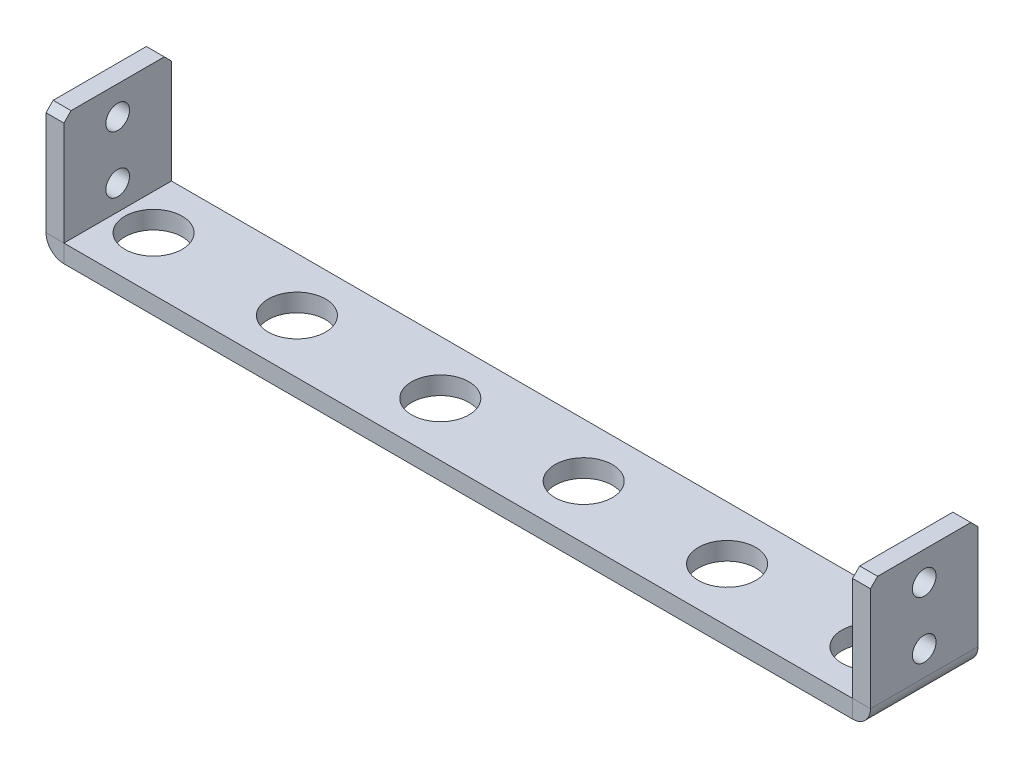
ISO-10303-21;
HEADER;
FILE_DESCRIPTION(('STEP AP214'),'2;1');
FILE_NAME('part.step','',(''),(''),'','','');
FILE_SCHEMA(('AUTOMOTIVE_DESIGN { 1 0 10303 214 1 1 1 1 }'));
ENDSEC;
DATA;
#1=APPLICATION_CONTEXT('core data for automotive mechanical design processes');
#2=APPLICATION_PROTOCOL_DEFINITION('international standard','automotive_design',2000,#1);
#3=PRODUCT_CONTEXT('',#1,'mechanical');
#4=PRODUCT('Part','Part','',(#3));
#5=PRODUCT_RELATED_PRODUCT_CATEGORY('part','',(#4));
#6=PRODUCT_DEFINITION_FORMATION('','',#4);
#7=PRODUCT_DEFINITION_CONTEXT('part definition',#1,'design');
#8=PRODUCT_DEFINITION('design','',#6,#7);
#9=PRODUCT_DEFINITION_SHAPE('','',#8);
#10=(LENGTH_UNIT() NAMED_UNIT(*) SI_UNIT(.MILLI.,.METRE.));
#11=(NAMED_UNIT(*) PLANE_ANGLE_UNIT() SI_UNIT($,.RADIAN.));
#12=(NAMED_UNIT(*) SI_UNIT($,.STERADIAN.) SOLID_ANGLE_UNIT());
#13=UNCERTAINTY_MEASURE_WITH_UNIT(LENGTH_MEASURE(1.E-05),#10,'distance_accuracy_value','');
#14=(GEOMETRIC_REPRESENTATION_CONTEXT(3) GLOBAL_UNCERTAINTY_ASSIGNED_CONTEXT((#13)) GLOBAL_UNIT_ASSIGNED_CONTEXT((#10,
#11,#12)) REPRESENTATION_CONTEXT('',''));
#15=CARTESIAN_POINT('',(0.,0.,0.));
#16=DIRECTION('',(0.,0.,1.));
#17=DIRECTION('',(1.,0.,0.));
#18=AXIS2_PLACEMENT_3D('',#15,#16,#17);
#19=CARTESIAN_POINT('',(-55.,2.5,-7.5));
#20=DIRECTION('',(0.,0.,-1.));
#21=DIRECTION('',(-1.,0.,0.));
#22=AXIS2_PLACEMENT_3D('',#19,#20,#21);
#23=PLANE('',#22);
#24=DIRECTION('',(0.,-1.,0.));
#25=VECTOR('',#24,1.);
#26=CARTESIAN_POINT('',(-55.,2.5,-7.5));
#27=LINE('',#26,#25);
#28=CARTESIAN_POINT('',(-55.,2.5,-7.5));
#29=VERTEX_POINT('',#28);
#30=CARTESIAN_POINT('',(-55.,0.,-7.5));
#31=VERTEX_POINT('',#30);
#32=EDGE_CURVE('E313',#29,#31,#27,.T.);
#33=ORIENTED_EDGE('',*,*,#32,.F.);
#34=DIRECTION('',(1.,0.,0.));
#35=VECTOR('',#34,1.);
#36=CARTESIAN_POINT('',(-57.5,2.5,-7.5));
#37=LINE('',#36,#35);
#38=CARTESIAN_POINT('',(55.,2.5,-7.5));
#39=VERTEX_POINT('',#38);
#40=EDGE_CURVE('E279',#39,#29,#37,.F.);
#41=ORIENTED_EDGE('',*,*,#40,.F.);
#42=DIRECTION('',(0.,-1.,0.));
#43=VECTOR('',#42,1.);
#44=CARTESIAN_POINT('',(55.,2.5,-7.5));
#45=LINE('',#44,#43);
#46=CARTESIAN_POINT('',(55.,0.,-7.5));
#47=VERTEX_POINT('',#46);
#48=EDGE_CURVE('E11',#39,#47,#45,.T.);
#49=ORIENTED_EDGE('',*,*,#48,.T.);
#50=DIRECTION('',(-1.,0.,0.));
#51=VECTOR('',#50,1.);
#52=CARTESIAN_POINT('',(-57.5,0.,-7.5));
#53=LINE('',#52,#51);
#54=EDGE_CURVE('E272',#47,#31,#53,.T.);
#55=ORIENTED_EDGE('',*,*,#54,.T.);
#56=EDGE_LOOP('',(#33,#41,#49,#55));
#57=FACE_BOUND('',#56,.T.);
#58=ADVANCED_FACE('F37',(#57),#23,.T.);
#59=CARTESIAN_POINT('',(55.,2.5,7.5));
#60=DIRECTION('',(0.,0.,1.));
#61=DIRECTION('',(1.,0.,0.));
#62=AXIS2_PLACEMENT_3D('',#59,#60,#61);
#63=PLANE('',#62);
#64=DIRECTION('',(0.,-1.,0.));
#65=VECTOR('',#64,1.);
#66=CARTESIAN_POINT('',(55.,2.5,7.5));
#67=LINE('',#66,#65);
#68=CARTESIAN_POINT('',(55.,2.5,7.5));
#69=VERTEX_POINT('',#68);
#70=CARTESIAN_POINT('',(55.,0.,7.5));
#71=VERTEX_POINT('',#70);
#72=EDGE_CURVE('E323',#69,#71,#67,.T.);
#73=ORIENTED_EDGE('',*,*,#72,.F.);
#74=DIRECTION('',(1.,0.,0.));
#75=VECTOR('',#74,1.);
#76=CARTESIAN_POINT('',(-57.5,2.5,7.5));
#77=LINE('',#76,#75);
#78=CARTESIAN_POINT('',(-55.,2.5,7.5));
#79=VERTEX_POINT('',#78);
#80=EDGE_CURVE('E278',#69,#79,#77,.F.);
#81=ORIENTED_EDGE('',*,*,#80,.T.);
#82=DIRECTION('',(0.,-1.,0.));
#83=VECTOR('',#82,1.);
#84=CARTESIAN_POINT('',(-55.,2.5,7.5));
#85=LINE('',#84,#83);
#86=CARTESIAN_POINT('',(-55.,0.,7.5));
#87=VERTEX_POINT('',#86);
#88=EDGE_CURVE('E317',#79,#87,#85,.T.);
#89=ORIENTED_EDGE('',*,*,#88,.T.);
#90=DIRECTION('',(-1.,0.,0.));
#91=VECTOR('',#90,1.);
#92=CARTESIAN_POINT('',(-57.5,0.,7.5));
#93=LINE('',#92,#91);
#94=EDGE_CURVE('E275',#71,#87,#93,.T.);
#95=ORIENTED_EDGE('',*,*,#94,.F.);
#96=EDGE_LOOP('',(#73,#81,#89,#95));
#97=FACE_BOUND('',#96,.T.);
#98=ADVANCED_FACE('F333',(#97),#63,.T.);
#99=CARTESIAN_POINT('',(-57.5,0.,7.5));
#100=DIRECTION('',(0.,-1.,0.));
#101=DIRECTION('',(0.,0.,-1.));
#102=AXIS2_PLACEMENT_3D('',#99,#100,#101);
#103=PLANE('',#102);
#104=CARTESIAN_POINT('',(-30.,0.,0.));
#105=DIRECTION('',(0.,1.,0.));
#106=DIRECTION('',(0.,0.,1.));
#107=AXIS2_PLACEMENT_3D('',#104,#105,#106);
#108=CIRCLE('',#107,4.);
#109=CARTESIAN_POINT('',(-30.,0.,4.));
#110=VERTEX_POINT('',#109);
#111=EDGE_CURVE('E262',#110,#110,#108,.T.);
#112=ORIENTED_EDGE('',*,*,#111,.T.);
#113=EDGE_LOOP('',(#112));
#114=FACE_BOUND('',#113,.T.);
#115=CARTESIAN_POINT('',(-50.,0.,0.));
#116=DIRECTION('',(0.,1.,0.));
#117=DIRECTION('',(0.,0.,1.));
#118=AXIS2_PLACEMENT_3D('',#115,#116,#117);
#119=CIRCLE('',#118,4.);
#120=CARTESIAN_POINT('',(-50.,0.,4.));
#121=VERTEX_POINT('',#120);
#122=EDGE_CURVE('E269',#121,#121,#119,.T.);
#123=ORIENTED_EDGE('',*,*,#122,.T.);
#124=EDGE_LOOP('',(#123));
#125=FACE_BOUND('',#124,.T.);
#126=ORIENTED_EDGE('',*,*,#54,.F.);
#127=DIRECTION('',(0.,0.,-1.));
#128=VECTOR('',#127,1.);
#129=CARTESIAN_POINT('',(55.,0.,7.5));
#130=LINE('',#129,#128);
#131=EDGE_CURVE('E45',#71,#47,#130,.T.);
#132=ORIENTED_EDGE('',*,*,#131,.F.);
#133=ORIENTED_EDGE('',*,*,#94,.T.);
#134=DIRECTION('',(0.,0.,-1.));
#135=VECTOR('',#134,1.);
#136=CARTESIAN_POINT('',(-55.,0.,7.5));
#137=LINE('',#136,#135);
#138=EDGE_CURVE('E59',#87,#31,#137,.T.);
#139=ORIENTED_EDGE('',*,*,#138,.T.);
#140=EDGE_LOOP('',(#126,#132,#133,#139));
#141=FACE_BOUND('',#140,.T.);
#142=CARTESIAN_POINT('',(-9.99999999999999,0.,0.));
#143=DIRECTION('',(0.,1.,0.));
#144=DIRECTION('',(0.,0.,1.));
#145=AXIS2_PLACEMENT_3D('',#142,#143,#144);
#146=CIRCLE('',#145,4.);
#147=CARTESIAN_POINT('',(-9.99999999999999,0.,4.));
#148=VERTEX_POINT('',#147);
#149=EDGE_CURVE('E282',#148,#148,#146,.T.);
#150=ORIENTED_EDGE('',*,*,#149,.T.);
#151=EDGE_LOOP('',(#150));
#152=FACE_BOUND('',#151,.T.);
#153=CARTESIAN_POINT('',(10.,0.,0.));
#154=DIRECTION('',(0.,1.,0.));
#155=DIRECTION('',(0.,0.,1.));
#156=AXIS2_PLACEMENT_3D('',#153,#154,#155);
#157=CIRCLE('',#156,4.);
#158=CARTESIAN_POINT('',(10.,0.,4.));
#159=VERTEX_POINT('',#158);
#160=EDGE_CURVE('E292',#159,#159,#157,.T.);
#161=ORIENTED_EDGE('',*,*,#160,.T.);
#162=EDGE_LOOP('',(#161));
#163=FACE_BOUND('',#162,.T.);
#164=CARTESIAN_POINT('',(30.,0.,0.));
#165=DIRECTION('',(0.,1.,0.));
#166=DIRECTION('',(0.,0.,1.));
#167=AXIS2_PLACEMENT_3D('',#164,#165,#166);
#168=CIRCLE('',#167,4.);
#169=CARTESIAN_POINT('',(30.,0.,4.));
#170=VERTEX_POINT('',#169);
#171=EDGE_CURVE('E298',#170,#170,#168,.T.);
#172=ORIENTED_EDGE('',*,*,#171,.T.);
#173=EDGE_LOOP('',(#172));
#174=FACE_BOUND('',#173,.T.);
#175=CARTESIAN_POINT('',(50.,0.,0.));
#176=DIRECTION('',(0.,1.,0.));
#177=DIRECTION('',(0.,0.,1.));
#178=AXIS2_PLACEMENT_3D('',#175,#176,#177);
#179=CIRCLE('',#178,4.);
#180=CARTESIAN_POINT('',(50.,0.,4.));
#181=VERTEX_POINT('',#180);
#182=EDGE_CURVE('E304',#181,#181,#179,.T.);
#183=ORIENTED_EDGE('',*,*,#182,.T.);
#184=EDGE_LOOP('',(#183));
#185=FACE_BOUND('',#184,.T.);
#186=ADVANCED_FACE('F336',(#114,#125,#141,#152,#163,#174,#185),#103,.T.);
#187=CARTESIAN_POINT('',(-57.5,2.5,7.5));
#188=DIRECTION('',(0.,-1.,0.));
#189=DIRECTION('',(0.,0.,-1.));
#190=AXIS2_PLACEMENT_3D('',#187,#188,#189);
#191=PLANE('',#190);
#192=CARTESIAN_POINT('',(-30.,2.5,0.));
#193=DIRECTION('',(0.,1.,0.));
#194=DIRECTION('',(0.,0.,1.));
#195=AXIS2_PLACEMENT_3D('',#192,#193,#194);
#196=CIRCLE('',#195,4.);
#197=CARTESIAN_POINT('',(-30.,2.5,4.));
#198=VERTEX_POINT('',#197);
#199=EDGE_CURVE('E265',#198,#198,#196,.T.);
#200=ORIENTED_EDGE('',*,*,#199,.F.);
#201=EDGE_LOOP('',(#200));
#202=FACE_BOUND('',#201,.T.);
#203=CARTESIAN_POINT('',(-50.,2.5,0.));
#204=DIRECTION('',(0.,1.,0.));
#205=DIRECTION('',(0.,0.,1.));
#206=AXIS2_PLACEMENT_3D('',#203,#204,#205);
#207=CIRCLE('',#206,4.);
#208=CARTESIAN_POINT('',(-50.,2.5,4.));
#209=VERTEX_POINT('',#208);
#210=EDGE_CURVE('E268',#209,#209,#207,.T.);
#211=ORIENTED_EDGE('',*,*,#210,.F.);
#212=EDGE_LOOP('',(#211));
#213=FACE_BOUND('',#212,.T.);
#214=ORIENTED_EDGE('',*,*,#40,.T.);
#215=DIRECTION('',(0.,0.,-1.));
#216=VECTOR('',#215,1.);
#217=CARTESIAN_POINT('',(-55.,2.5,7.5));
#218=LINE('',#217,#216);
#219=EDGE_CURVE('E310',#79,#29,#218,.T.);
#220=ORIENTED_EDGE('',*,*,#219,.F.);
#221=ORIENTED_EDGE('',*,*,#80,.F.);
#222=DIRECTION('',(0.,0.,-1.));
#223=VECTOR('',#222,1.);
#224=CARTESIAN_POINT('',(55.,2.5,7.5));
#225=LINE('',#224,#223);
#226=EDGE_CURVE('E320',#69,#39,#225,.T.);
#227=ORIENTED_EDGE('',*,*,#226,.T.);
#228=EDGE_LOOP('',(#214,#220,#221,#227));
#229=FACE_BOUND('',#228,.T.);
#230=CARTESIAN_POINT('',(-9.99999999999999,2.5,0.));
#231=DIRECTION('',(0.,1.,0.));
#232=DIRECTION('',(0.,0.,1.));
#233=AXIS2_PLACEMENT_3D('',#230,#231,#232);
#234=CIRCLE('',#233,4.);
#235=CARTESIAN_POINT('',(-9.99999999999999,2.5,4.));
#236=VERTEX_POINT('',#235);
#237=EDGE_CURVE('E289',#236,#236,#234,.T.);
#238=ORIENTED_EDGE('',*,*,#237,.F.);
#239=EDGE_LOOP('',(#238));
#240=FACE_BOUND('',#239,.T.);
#241=CARTESIAN_POINT('',(10.,2.5,0.));
#242=DIRECTION('',(0.,1.,0.));
#243=DIRECTION('',(0.,0.,1.));
#244=AXIS2_PLACEMENT_3D('',#241,#242,#243);
#245=CIRCLE('',#244,4.);
#246=CARTESIAN_POINT('',(10.,2.5,4.));
#247=VERTEX_POINT('',#246);
#248=EDGE_CURVE('E295',#247,#247,#245,.T.);
#249=ORIENTED_EDGE('',*,*,#248,.F.);
#250=EDGE_LOOP('',(#249));
#251=FACE_BOUND('',#250,.T.);
#252=CARTESIAN_POINT('',(30.,2.5,0.));
#253=DIRECTION('',(0.,1.,0.));
#254=DIRECTION('',(0.,0.,1.));
#255=AXIS2_PLACEMENT_3D('',#252,#253,#254);
#256=CIRCLE('',#255,4.);
#257=CARTESIAN_POINT('',(30.,2.5,4.));
#258=VERTEX_POINT('',#257);
#259=EDGE_CURVE('E301',#258,#258,#256,.T.);
#260=ORIENTED_EDGE('',*,*,#259,.F.);
#261=EDGE_LOOP('',(#260));
#262=FACE_BOUND('',#261,.T.);
#263=CARTESIAN_POINT('',(50.,2.5,0.));
#264=DIRECTION('',(0.,1.,0.));
#265=DIRECTION('',(0.,0.,1.));
#266=AXIS2_PLACEMENT_3D('',#263,#264,#265);
#267=CIRCLE('',#266,4.);
#268=CARTESIAN_POINT('',(50.,2.5,4.));
#269=VERTEX_POINT('',#268);
#270=EDGE_CURVE('E307',#269,#269,#267,.T.);
#271=ORIENTED_EDGE('',*,*,#270,.F.);
#272=EDGE_LOOP('',(#271));
#273=FACE_BOUND('',#272,.T.);
#274=ADVANCED_FACE('F346',(#202,#213,#229,#240,#251,#262,#273),#191,.F.);
#275=CARTESIAN_POINT('',(-50.,0.,0.));
#276=DIRECTION('',(0.,1.,0.));
#277=DIRECTION('',(0.,0.,1.));
#278=AXIS2_PLACEMENT_3D('',#275,#276,#277);
#279=CYLINDRICAL_SURFACE('',#278,4.);
#280=ORIENTED_EDGE('',*,*,#122,.F.);
#281=EDGE_LOOP('',(#280));
#282=FACE_BOUND('',#281,.T.);
#283=ORIENTED_EDGE('',*,*,#210,.T.);
#284=EDGE_LOOP('',(#283));
#285=FACE_BOUND('',#284,.T.);
#286=ADVANCED_FACE('F407',(#282,#285),#279,.F.);
#287=CARTESIAN_POINT('',(-30.,0.,0.));
#288=DIRECTION('',(0.,1.,0.));
#289=DIRECTION('',(0.,0.,1.));
#290=AXIS2_PLACEMENT_3D('',#287,#288,#289);
#291=CYLINDRICAL_SURFACE('',#290,4.);
#292=ORIENTED_EDGE('',*,*,#111,.F.);
#293=EDGE_LOOP('',(#292));
#294=FACE_BOUND('',#293,.T.);
#295=ORIENTED_EDGE('',*,*,#199,.T.);
#296=EDGE_LOOP('',(#295));
#297=FACE_BOUND('',#296,.T.);
#298=ADVANCED_FACE('F389',(#294,#297),#291,.F.);
#299=CARTESIAN_POINT('',(-9.99999999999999,0.,0.));
#300=DIRECTION('',(0.,1.,0.));
#301=DIRECTION('',(0.,0.,1.));
#302=AXIS2_PLACEMENT_3D('',#299,#300,#301);
#303=CYLINDRICAL_SURFACE('',#302,4.);
#304=ORIENTED_EDGE('',*,*,#149,.F.);
#305=EDGE_LOOP('',(#304));
#306=FACE_BOUND('',#305,.T.);
#307=ORIENTED_EDGE('',*,*,#237,.T.);
#308=EDGE_LOOP('',(#307));
#309=FACE_BOUND('',#308,.T.);
#310=ADVANCED_FACE('F385',(#306,#309),#303,.F.);
#311=CARTESIAN_POINT('',(10.,0.,0.));
#312=DIRECTION('',(0.,1.,0.));
#313=DIRECTION('',(0.,0.,1.));
#314=AXIS2_PLACEMENT_3D('',#311,#312,#313);
#315=CYLINDRICAL_SURFACE('',#314,4.);
#316=ORIENTED_EDGE('',*,*,#160,.F.);
#317=EDGE_LOOP('',(#316));
#318=FACE_BOUND('',#317,.T.);
#319=ORIENTED_EDGE('',*,*,#248,.T.);
#320=EDGE_LOOP('',(#319));
#321=FACE_BOUND('',#320,.T.);
#322=ADVANCED_FACE('F388',(#318,#321),#315,.F.);
#323=CARTESIAN_POINT('',(30.,0.,0.));
#324=DIRECTION('',(0.,1.,0.));
#325=DIRECTION('',(0.,0.,1.));
#326=AXIS2_PLACEMENT_3D('',#323,#324,#325);
#327=CYLINDRICAL_SURFACE('',#326,4.);
#328=ORIENTED_EDGE('',*,*,#171,.F.);
#329=EDGE_LOOP('',(#328));
#330=FACE_BOUND('',#329,.T.);
#331=ORIENTED_EDGE('',*,*,#259,.T.);
#332=EDGE_LOOP('',(#331));
#333=FACE_BOUND('',#332,.T.);
#334=ADVANCED_FACE('F392',(#330,#333),#327,.F.);
#335=CARTESIAN_POINT('',(50.,0.,0.));
#336=DIRECTION('',(0.,1.,0.));
#337=DIRECTION('',(0.,0.,1.));
#338=AXIS2_PLACEMENT_3D('',#335,#336,#337);
#339=CYLINDRICAL_SURFACE('',#338,4.);
#340=ORIENTED_EDGE('',*,*,#182,.F.);
#341=EDGE_LOOP('',(#340));
#342=FACE_BOUND('',#341,.T.);
#343=ORIENTED_EDGE('',*,*,#270,.T.);
#344=EDGE_LOOP('',(#343));
#345=FACE_BOUND('',#344,.T.);
#346=ADVANCED_FACE('F39',(#342,#345),#339,.F.);
#347=CARTESIAN_POINT('',(-55.,2.5,-7.5));
#348=DIRECTION('',(0.,0.,1.));
#349=DIRECTION('',(1.,0.,0.));
#350=AXIS2_PLACEMENT_3D('',#347,#348,#349);
#351=PLANE('',#350);
#352=CARTESIAN_POINT('',(-55.,2.5,-7.5));
#353=DIRECTION('',(0.,0.,1.));
#354=DIRECTION('',(1.,0.,0.));
#355=AXIS2_PLACEMENT_3D('',#352,#353,#354);
#356=CIRCLE('',#355,2.50000000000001);
#357=CARTESIAN_POINT('',(-57.5,2.5,-7.5));
#358=VERTEX_POINT('',#357);
#359=EDGE_CURVE('E260',#358,#31,#356,.T.);
#360=ORIENTED_EDGE('',*,*,#359,.F.);
#361=DIRECTION('',(-1.,0.,0.));
#362=VECTOR('',#361,1.);
#363=CARTESIAN_POINT('',(-55.,2.5,-7.5));
#364=LINE('',#363,#362);
#365=EDGE_CURVE('E219',#29,#358,#364,.T.);
#366=ORIENTED_EDGE('',*,*,#365,.F.);
#367=ORIENTED_EDGE('',*,*,#32,.T.);
#368=EDGE_LOOP('',(#360,#366,#367));
#369=FACE_BOUND('',#368,.T.);
#370=ADVANCED_FACE('F399',(#369),#351,.F.);
#371=CARTESIAN_POINT('',(-55.,2.5,7.5));
#372=DIRECTION('',(0.,0.,1.));
#373=DIRECTION('',(1.,0.,0.));
#374=AXIS2_PLACEMENT_3D('',#371,#372,#373);
#375=CYLINDRICAL_SURFACE('',#374,2.50000000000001);
#376=CARTESIAN_POINT('',(-55.,2.5,7.5));
#377=DIRECTION('',(0.,0.,1.));
#378=DIRECTION('',(1.,0.,0.));
#379=AXIS2_PLACEMENT_3D('',#376,#377,#378);
#380=CIRCLE('',#379,2.50000000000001);
#381=CARTESIAN_POINT('',(-57.5,2.50000000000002,7.5));
#382=VERTEX_POINT('',#381);
#383=EDGE_CURVE('E205',#382,#87,#380,.T.);
#384=ORIENTED_EDGE('',*,*,#383,.F.);
#385=DIRECTION('',(0.,0.,-1.));
#386=VECTOR('',#385,1.);
#387=CARTESIAN_POINT('',(-57.5,2.5,7.5));
#388=LINE('',#387,#386);
#389=EDGE_CURVE('E255',#382,#358,#388,.T.);
#390=ORIENTED_EDGE('',*,*,#389,.T.);
#391=ORIENTED_EDGE('',*,*,#359,.T.);
#392=ORIENTED_EDGE('',*,*,#138,.F.);
#393=EDGE_LOOP('',(#384,#390,#391,#392));
#394=FACE_BOUND('',#393,.T.);
#395=ADVANCED_FACE('F427',(#394),#375,.T.);
#396=CARTESIAN_POINT('',(-55.,2.5,7.5));
#397=DIRECTION('',(0.,0.,1.));
#398=DIRECTION('',(1.,0.,0.));
#399=AXIS2_PLACEMENT_3D('',#396,#397,#398);
#400=PLANE('',#399);
#401=DIRECTION('',(-1.,0.,0.));
#402=VECTOR('',#401,1.);
#403=CARTESIAN_POINT('',(-55.,2.5,7.5));
#404=LINE('',#403,#402);
#405=EDGE_CURVE('E202',#79,#382,#404,.T.);
#406=ORIENTED_EDGE('',*,*,#405,.T.);
#407=ORIENTED_EDGE('',*,*,#383,.T.);
#408=ORIENTED_EDGE('',*,*,#88,.F.);
#409=EDGE_LOOP('',(#406,#407,#408));
#410=FACE_BOUND('',#409,.T.);
#411=ADVANCED_FACE('F431',(#410),#400,.T.);
#412=CARTESIAN_POINT('',(-55.,17.,-7.5));
#413=DIRECTION('',(0.,-0.707106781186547,0.707106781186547));
#414=DIRECTION('',(0.,-0.707106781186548,-0.707106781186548));
#415=AXIS2_PLACEMENT_3D('',#412,#413,#414);
#416=PLANE('',#415);
#417=DIRECTION('',(0.,0.707106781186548,0.707106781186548));
#418=VECTOR('',#417,1.);
#419=CARTESIAN_POINT('',(-57.5,25.,0.5));
#420=LINE('',#419,#418);
#421=CARTESIAN_POINT('',(-57.5,18.,-6.5));
#422=VERTEX_POINT('',#421);
#423=CARTESIAN_POINT('',(-57.5,17.,-7.5));
#424=VERTEX_POINT('',#423);
#425=EDGE_CURVE('E209',#422,#424,#420,.F.);
#426=ORIENTED_EDGE('',*,*,#425,.F.);
#427=DIRECTION('',(-1.,0.,0.));
#428=VECTOR('',#427,1.);
#429=CARTESIAN_POINT('',(-57.5,18.,-6.5));
#430=LINE('',#429,#428);
#431=CARTESIAN_POINT('',(-55.,18.,-6.5));
#432=VERTEX_POINT('',#431);
#433=EDGE_CURVE('E247',#432,#422,#430,.T.);
#434=ORIENTED_EDGE('',*,*,#433,.F.);
#435=DIRECTION('',(0.,-0.707106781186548,-0.707106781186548));
#436=VECTOR('',#435,1.);
#437=CARTESIAN_POINT('',(-55.,17.,-7.5));
#438=LINE('',#437,#436);
#439=CARTESIAN_POINT('',(-55.,17.,-7.5));
#440=VERTEX_POINT('',#439);
#441=EDGE_CURVE('E228',#440,#432,#438,.F.);
#442=ORIENTED_EDGE('',*,*,#441,.F.);
#443=DIRECTION('',(1.,0.,0.));
#444=VECTOR('',#443,1.);
#445=CARTESIAN_POINT('',(-55.,17.,-7.5));
#446=LINE('',#445,#444);
#447=EDGE_CURVE('E222',#424,#440,#446,.T.);
#448=ORIENTED_EDGE('',*,*,#447,.F.);
#449=EDGE_LOOP('',(#426,#434,#442,#448));
#450=FACE_BOUND('',#449,.T.);
#451=ADVANCED_FACE('F434',(#450),#416,.F.);
#452=CARTESIAN_POINT('',(-57.5,18.,6.49999999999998));
#453=DIRECTION('',(0.,-0.707106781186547,-0.707106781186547));
#454=DIRECTION('',(0.,0.707106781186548,-0.707106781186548));
#455=AXIS2_PLACEMENT_3D('',#452,#453,#454);
#456=PLANE('',#455);
#457=DIRECTION('',(0.,-0.707106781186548,0.707106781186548));
#458=VECTOR('',#457,1.);
#459=CARTESIAN_POINT('',(-57.5,17.5,6.99999999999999));
#460=LINE('',#459,#458);
#461=CARTESIAN_POINT('',(-57.5,17.,7.5));
#462=VERTEX_POINT('',#461);
#463=CARTESIAN_POINT('',(-57.5,18.,6.49999999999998));
#464=VERTEX_POINT('',#463);
#465=EDGE_CURVE('E214',#462,#464,#460,.F.);
#466=ORIENTED_EDGE('',*,*,#465,.F.);
#467=DIRECTION('',(-1.,0.,0.));
#468=VECTOR('',#467,1.);
#469=CARTESIAN_POINT('',(-55.,17.,7.5));
#470=LINE('',#469,#468);
#471=CARTESIAN_POINT('',(-55.,17.,7.5));
#472=VERTEX_POINT('',#471);
#473=EDGE_CURVE('E203',#472,#462,#470,.T.);
#474=ORIENTED_EDGE('',*,*,#473,.F.);
#475=DIRECTION('',(0.,0.707106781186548,-0.707106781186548));
#476=VECTOR('',#475,1.);
#477=CARTESIAN_POINT('',(-55.,18.,6.49999999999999));
#478=LINE('',#477,#476);
#479=CARTESIAN_POINT('',(-55.,18.,6.49999999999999));
#480=VERTEX_POINT('',#479);
#481=EDGE_CURVE('E233',#480,#472,#478,.F.);
#482=ORIENTED_EDGE('',*,*,#481,.F.);
#483=DIRECTION('',(1.,0.,0.));
#484=VECTOR('',#483,1.);
#485=CARTESIAN_POINT('',(-57.5,18.,6.49999999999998));
#486=LINE('',#485,#484);
#487=EDGE_CURVE('E252',#464,#480,#486,.T.);
#488=ORIENTED_EDGE('',*,*,#487,.F.);
#489=EDGE_LOOP('',(#466,#474,#482,#488));
#490=FACE_BOUND('',#489,.T.);
#491=ADVANCED_FACE('F463',(#490),#456,.F.);
#492=CARTESIAN_POINT('',(-57.5,18.,7.5));
#493=DIRECTION('',(0.,1.,0.));
#494=DIRECTION('',(0.,0.,1.));
#495=AXIS2_PLACEMENT_3D('',#492,#493,#494);
#496=PLANE('',#495);
#497=DIRECTION('',(0.,0.,-1.));
#498=VECTOR('',#497,1.);
#499=CARTESIAN_POINT('',(-57.5,18.,7.5));
#500=LINE('',#499,#498);
#501=EDGE_CURVE('E211',#464,#422,#500,.T.);
#502=ORIENTED_EDGE('',*,*,#501,.F.);
#503=ORIENTED_EDGE('',*,*,#487,.T.);
#504=DIRECTION('',(0.,0.,-1.));
#505=VECTOR('',#504,1.);
#506=CARTESIAN_POINT('',(-55.,18.,7.5));
#507=LINE('',#506,#505);
#508=EDGE_CURVE('E249',#480,#432,#507,.T.);
#509=ORIENTED_EDGE('',*,*,#508,.T.);
#510=ORIENTED_EDGE('',*,*,#433,.T.);
#511=EDGE_LOOP('',(#502,#503,#509,#510));
#512=FACE_BOUND('',#511,.T.);
#513=ADVANCED_FACE('F459',(#512),#496,.T.);
#514=CARTESIAN_POINT('',(-55.,6.,0.));
#515=DIRECTION('',(1.,0.,0.));
#516=DIRECTION('',(0.,0.,1.));
#517=AXIS2_PLACEMENT_3D('',#514,#515,#516);
#518=CYLINDRICAL_SURFACE('',#517,1.64999999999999);
#519=CARTESIAN_POINT('',(-57.5,6.,0.));
#520=DIRECTION('',(-1.,0.,0.));
#521=DIRECTION('',(0.,-1.,0.));
#522=AXIS2_PLACEMENT_3D('',#519,#520,#521);
#523=CIRCLE('',#522,1.64999999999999);
#524=CARTESIAN_POINT('',(-57.5,4.35000000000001,0.));
#525=VERTEX_POINT('',#524);
#526=EDGE_CURVE('E244',#525,#525,#523,.T.);
#527=ORIENTED_EDGE('',*,*,#526,.T.);
#528=EDGE_LOOP('',(#527));
#529=FACE_BOUND('',#528,.T.);
#530=CARTESIAN_POINT('',(-55.,6.,0.));
#531=DIRECTION('',(1.,0.,0.));
#532=DIRECTION('',(0.,0.,1.));
#533=AXIS2_PLACEMENT_3D('',#530,#531,#532);
#534=CIRCLE('',#533,1.64999999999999);
#535=CARTESIAN_POINT('',(-55.,6.,1.64999999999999));
#536=VERTEX_POINT('',#535);
#537=EDGE_CURVE('E241',#536,#536,#534,.T.);
#538=ORIENTED_EDGE('',*,*,#537,.T.);
#539=EDGE_LOOP('',(#538));
#540=FACE_BOUND('',#539,.T.);
#541=ADVANCED_FACE('F455',(#529,#540),#518,.F.);
#542=CARTESIAN_POINT('',(-55.,14.,0.));
#543=DIRECTION('',(1.,0.,0.));
#544=DIRECTION('',(0.,0.,1.));
#545=AXIS2_PLACEMENT_3D('',#542,#543,#544);
#546=CYLINDRICAL_SURFACE('',#545,1.64999999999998);
#547=CARTESIAN_POINT('',(-57.5,14.,0.));
#548=DIRECTION('',(-1.,0.,0.));
#549=DIRECTION('',(0.,-1.,0.));
#550=AXIS2_PLACEMENT_3D('',#547,#548,#549);
#551=CIRCLE('',#550,1.64999999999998);
#552=CARTESIAN_POINT('',(-57.5,12.35,0.));
#553=VERTEX_POINT('',#552);
#554=EDGE_CURVE('E238',#553,#553,#551,.T.);
#555=ORIENTED_EDGE('',*,*,#554,.T.);
#556=EDGE_LOOP('',(#555));
#557=FACE_BOUND('',#556,.T.);
#558=CARTESIAN_POINT('',(-55.,14.,0.));
#559=DIRECTION('',(1.,0.,0.));
#560=DIRECTION('',(0.,0.,1.));
#561=AXIS2_PLACEMENT_3D('',#558,#559,#560);
#562=CIRCLE('',#561,1.64999999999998);
#563=CARTESIAN_POINT('',(-55.,14.,1.64999999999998));
#564=VERTEX_POINT('',#563);
#565=EDGE_CURVE('E235',#564,#564,#562,.T.);
#566=ORIENTED_EDGE('',*,*,#565,.T.);
#567=EDGE_LOOP('',(#566));
#568=FACE_BOUND('',#567,.T.);
#569=ADVANCED_FACE('F451',(#557,#568),#546,.F.);
#570=CARTESIAN_POINT('',(-55.,18.,7.5));
#571=DIRECTION('',(-1.,0.,0.));
#572=DIRECTION('',(0.,-1.,0.));
#573=AXIS2_PLACEMENT_3D('',#570,#571,#572);
#574=PLANE('',#573);
#575=ORIENTED_EDGE('',*,*,#565,.F.);
#576=EDGE_LOOP('',(#575));
#577=FACE_BOUND('',#576,.T.);
#578=ORIENTED_EDGE('',*,*,#537,.F.);
#579=EDGE_LOOP('',(#578));
#580=FACE_BOUND('',#579,.T.);
#581=ORIENTED_EDGE('',*,*,#508,.F.);
#582=ORIENTED_EDGE('',*,*,#481,.T.);
#583=DIRECTION('',(0.,1.,0.));
#584=VECTOR('',#583,1.);
#585=CARTESIAN_POINT('',(-55.,18.,7.5));
#586=LINE('',#585,#584);
#587=EDGE_CURVE('E206',#79,#472,#586,.T.);
#588=ORIENTED_EDGE('',*,*,#587,.F.);
#589=ORIENTED_EDGE('',*,*,#219,.T.);
#590=DIRECTION('',(0.,1.,0.));
#591=VECTOR('',#590,1.);
#592=CARTESIAN_POINT('',(-55.,18.,-7.5));
#593=LINE('',#592,#591);
#594=EDGE_CURVE('E230',#29,#440,#593,.T.);
#595=ORIENTED_EDGE('',*,*,#594,.T.);
#596=ORIENTED_EDGE('',*,*,#441,.T.);
#597=EDGE_LOOP('',(#581,#582,#588,#589,#595,#596));
#598=FACE_BOUND('',#597,.T.);
#599=ADVANCED_FACE('F447',(#577,#580,#598),#574,.F.);
#600=CARTESIAN_POINT('',(-55.,2.5,-7.5));
#601=DIRECTION('',(0.,0.,-1.));
#602=DIRECTION('',(-1.,0.,0.));
#603=AXIS2_PLACEMENT_3D('',#600,#601,#602);
#604=PLANE('',#603);
#605=DIRECTION('',(0.,1.,0.));
#606=VECTOR('',#605,1.);
#607=CARTESIAN_POINT('',(-57.5,18.,-7.5));
#608=LINE('',#607,#606);
#609=EDGE_CURVE('E225',#358,#424,#608,.T.);
#610=ORIENTED_EDGE('',*,*,#609,.T.);
#611=ORIENTED_EDGE('',*,*,#447,.T.);
#612=ORIENTED_EDGE('',*,*,#594,.F.);
#613=ORIENTED_EDGE('',*,*,#365,.T.);
#614=EDGE_LOOP('',(#610,#611,#612,#613));
#615=FACE_BOUND('',#614,.T.);
#616=ADVANCED_FACE('F443',(#615),#604,.T.);
#617=CARTESIAN_POINT('',(-57.5,18.,7.5));
#618=DIRECTION('',(-1.,0.,0.));
#619=DIRECTION('',(0.,-1.,0.));
#620=AXIS2_PLACEMENT_3D('',#617,#618,#619);
#621=PLANE('',#620);
#622=ORIENTED_EDGE('',*,*,#554,.F.);
#623=EDGE_LOOP('',(#622));
#624=FACE_BOUND('',#623,.T.);
#625=ORIENTED_EDGE('',*,*,#526,.F.);
#626=EDGE_LOOP('',(#625));
#627=FACE_BOUND('',#626,.T.);
#628=DIRECTION('',(0.,1.,0.));
#629=VECTOR('',#628,1.);
#630=CARTESIAN_POINT('',(-57.5,18.,7.5));
#631=LINE('',#630,#629);
#632=EDGE_CURVE('E216',#382,#462,#631,.T.);
#633=ORIENTED_EDGE('',*,*,#632,.T.);
#634=ORIENTED_EDGE('',*,*,#465,.T.);
#635=ORIENTED_EDGE('',*,*,#501,.T.);
#636=ORIENTED_EDGE('',*,*,#425,.T.);
#637=ORIENTED_EDGE('',*,*,#609,.F.);
#638=ORIENTED_EDGE('',*,*,#389,.F.);
#639=EDGE_LOOP('',(#633,#634,#635,#636,#637,#638));
#640=FACE_BOUND('',#639,.T.);
#641=ADVANCED_FACE('F439',(#624,#627,#640),#621,.T.);
#642=CARTESIAN_POINT('',(-55.,2.5,7.5));
#643=DIRECTION('',(0.,0.,1.));
#644=DIRECTION('',(1.,0.,0.));
#645=AXIS2_PLACEMENT_3D('',#642,#643,#644);
#646=PLANE('',#645);
#647=ORIENTED_EDGE('',*,*,#587,.T.);
#648=ORIENTED_EDGE('',*,*,#473,.T.);
#649=ORIENTED_EDGE('',*,*,#632,.F.);
#650=ORIENTED_EDGE('',*,*,#405,.F.);
#651=EDGE_LOOP('',(#647,#648,#649,#650));
#652=FACE_BOUND('',#651,.T.);
#653=ADVANCED_FACE('F436',(#652),#646,.T.);
#654=CARTESIAN_POINT('',(55.,2.5,7.5));
#655=DIRECTION('',(0.,0.,-1.));
#656=DIRECTION('',(-1.,0.,0.));
#657=AXIS2_PLACEMENT_3D('',#654,#655,#656);
#658=PLANE('',#657);
#659=CARTESIAN_POINT('',(55.,2.5,7.5));
#660=DIRECTION('',(0.,0.,-1.));
#661=DIRECTION('',(-1.,0.,0.));
#662=AXIS2_PLACEMENT_3D('',#659,#660,#661);
#663=CIRCLE('',#662,2.5);
#664=CARTESIAN_POINT('',(57.5,2.5,7.5));
#665=VERTEX_POINT('',#664);
#666=EDGE_CURVE('E199',#665,#71,#663,.T.);
#667=ORIENTED_EDGE('',*,*,#666,.F.);
#668=DIRECTION('',(1.,0.,0.));
#669=VECTOR('',#668,1.);
#670=CARTESIAN_POINT('',(55.,2.5,7.5));
#671=LINE('',#670,#669);
#672=EDGE_CURVE('E157',#69,#665,#671,.T.);
#673=ORIENTED_EDGE('',*,*,#672,.F.);
#674=ORIENTED_EDGE('',*,*,#72,.T.);
#675=EDGE_LOOP('',(#667,#673,#674));
#676=FACE_BOUND('',#675,.T.);
#677=ADVANCED_FACE('F329',(#676),#658,.F.);
#678=CARTESIAN_POINT('',(55.,2.5,-7.5));
#679=DIRECTION('',(0.,0.,-1.));
#680=DIRECTION('',(-1.,0.,0.));
#681=AXIS2_PLACEMENT_3D('',#678,#679,#680);
#682=CYLINDRICAL_SURFACE('',#681,2.5);
#683=CARTESIAN_POINT('',(55.,2.5,-7.5));
#684=DIRECTION('',(0.,0.,-1.));
#685=DIRECTION('',(-1.,0.,0.));
#686=AXIS2_PLACEMENT_3D('',#683,#684,#685);
#687=CIRCLE('',#686,2.5);
#688=CARTESIAN_POINT('',(57.5,2.50000000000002,-7.5));
#689=VERTEX_POINT('',#688);
#690=EDGE_CURVE('E197',#689,#47,#687,.T.);
#691=ORIENTED_EDGE('',*,*,#690,.F.);
#692=DIRECTION('',(0.,0.,-1.));
#693=VECTOR('',#692,1.);
#694=CARTESIAN_POINT('',(57.5,2.5,7.5));
#695=LINE('',#694,#693);
#696=EDGE_CURVE('E158',#665,#689,#695,.T.);
#697=ORIENTED_EDGE('',*,*,#696,.F.);
#698=ORIENTED_EDGE('',*,*,#666,.T.);
#699=ORIENTED_EDGE('',*,*,#131,.T.);
#700=EDGE_LOOP('',(#691,#697,#698,#699));
#701=FACE_BOUND('',#700,.T.);
#702=ADVANCED_FACE('F473',(#701),#682,.T.);
#703=CARTESIAN_POINT('',(55.,2.5,-7.5));
#704=DIRECTION('',(0.,0.,-1.));
#705=DIRECTION('',(-1.,0.,0.));
#706=AXIS2_PLACEMENT_3D('',#703,#704,#705);
#707=PLANE('',#706);
#708=DIRECTION('',(1.,0.,0.));
#709=VECTOR('',#708,1.);
#710=CARTESIAN_POINT('',(55.,2.5,-7.5));
#711=LINE('',#710,#709);
#712=EDGE_CURVE('E194',#39,#689,#711,.T.);
#713=ORIENTED_EDGE('',*,*,#712,.T.);
#714=ORIENTED_EDGE('',*,*,#690,.T.);
#715=ORIENTED_EDGE('',*,*,#48,.F.);
#716=EDGE_LOOP('',(#713,#714,#715));
#717=FACE_BOUND('',#716,.T.);
#718=ADVANCED_FACE('F342',(#717),#707,.T.);
#719=CARTESIAN_POINT('',(55.,18.,6.49999999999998));
#720=DIRECTION('',(0.,0.707106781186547,0.707106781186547));
#721=DIRECTION('',(0.,-0.707106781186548,0.707106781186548));
#722=AXIS2_PLACEMENT_3D('',#719,#720,#721);
#723=PLANE('',#722);
#724=DIRECTION('',(0.,0.707106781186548,-0.707106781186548));
#725=VECTOR('',#724,1.);
#726=CARTESIAN_POINT('',(55.,18.,6.49999999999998));
#727=LINE('',#726,#725);
#728=CARTESIAN_POINT('',(55.,17.,7.5));
#729=VERTEX_POINT('',#728);
#730=CARTESIAN_POINT('',(55.,18.,6.49999999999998));
#731=VERTEX_POINT('',#730);
#732=EDGE_CURVE('E162',#729,#731,#727,.T.);
#733=ORIENTED_EDGE('',*,*,#732,.F.);
#734=DIRECTION('',(-1.,0.,0.));
#735=VECTOR('',#734,1.);
#736=CARTESIAN_POINT('',(55.,17.,7.5));
#737=LINE('',#736,#735);
#738=CARTESIAN_POINT('',(57.5,17.,7.5));
#739=VERTEX_POINT('',#738);
#740=EDGE_CURVE('E155',#739,#729,#737,.T.);
#741=ORIENTED_EDGE('',*,*,#740,.F.);
#742=DIRECTION('',(0.,-0.707106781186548,0.707106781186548));
#743=VECTOR('',#742,1.);
#744=CARTESIAN_POINT('',(57.5,17.5,6.99999999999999));
#745=LINE('',#744,#743);
#746=CARTESIAN_POINT('',(57.5,18.,6.49999999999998));
#747=VERTEX_POINT('',#746);
#748=EDGE_CURVE('E137',#747,#739,#745,.T.);
#749=ORIENTED_EDGE('',*,*,#748,.F.);
#750=DIRECTION('',(1.,0.,0.));
#751=VECTOR('',#750,1.);
#752=CARTESIAN_POINT('',(57.5,18.,6.49999999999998));
#753=LINE('',#752,#751);
#754=EDGE_CURVE('E189',#731,#747,#753,.T.);
#755=ORIENTED_EDGE('',*,*,#754,.F.);
#756=EDGE_LOOP('',(#733,#741,#749,#755));
#757=FACE_BOUND('',#756,.T.);
#758=ADVANCED_FACE('F161',(#757),#723,.T.);
#759=CARTESIAN_POINT('',(55.,17.,-7.5));
#760=DIRECTION('',(0.,-0.707106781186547,0.707106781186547));
#761=DIRECTION('',(0.,-0.707106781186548,-0.707106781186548));
#762=AXIS2_PLACEMENT_3D('',#759,#760,#761);
#763=PLANE('',#762);
#764=DIRECTION('',(0.,0.707106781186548,0.707106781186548));
#765=VECTOR('',#764,1.);
#766=CARTESIAN_POINT('',(55.,17.,-7.5));
#767=LINE('',#766,#765);
#768=CARTESIAN_POINT('',(55.,18.,-6.49999999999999));
#769=VERTEX_POINT('',#768);
#770=CARTESIAN_POINT('',(55.,17.,-7.5));
#771=VERTEX_POINT('',#770);
#772=EDGE_CURVE('E172',#769,#771,#767,.F.);
#773=ORIENTED_EDGE('',*,*,#772,.F.);
#774=DIRECTION('',(-1.,0.,0.));
#775=VECTOR('',#774,1.);
#776=CARTESIAN_POINT('',(55.,18.,-6.5));
#777=LINE('',#776,#775);
#778=CARTESIAN_POINT('',(57.5,18.,-6.5));
#779=VERTEX_POINT('',#778);
#780=EDGE_CURVE('E191',#779,#769,#777,.T.);
#781=ORIENTED_EDGE('',*,*,#780,.F.);
#782=DIRECTION('',(0.,-0.707106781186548,-0.707106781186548));
#783=VECTOR('',#782,1.);
#784=CARTESIAN_POINT('',(57.5,25.,0.5));
#785=LINE('',#784,#783);
#786=CARTESIAN_POINT('',(57.5,17.,-7.5));
#787=VERTEX_POINT('',#786);
#788=EDGE_CURVE('E150',#787,#779,#785,.F.);
#789=ORIENTED_EDGE('',*,*,#788,.F.);
#790=DIRECTION('',(1.,0.,0.));
#791=VECTOR('',#790,1.);
#792=CARTESIAN_POINT('',(55.,17.,-7.5));
#793=LINE('',#792,#791);
#794=EDGE_CURVE('E357',#771,#787,#793,.T.);
#795=ORIENTED_EDGE('',*,*,#794,.F.);
#796=EDGE_LOOP('',(#773,#781,#789,#795));
#797=FACE_BOUND('',#796,.T.);
#798=ADVANCED_FACE('F367',(#797),#763,.F.);
#799=CARTESIAN_POINT('',(55.,18.,7.5));
#800=DIRECTION('',(0.,1.,0.));
#801=DIRECTION('',(0.,0.,1.));
#802=AXIS2_PLACEMENT_3D('',#799,#800,#801);
#803=PLANE('',#802);
#804=DIRECTION('',(0.,0.,-1.));
#805=VECTOR('',#804,1.);
#806=CARTESIAN_POINT('',(57.5,18.,7.5));
#807=LINE('',#806,#805);
#808=EDGE_CURVE('E145',#747,#779,#807,.T.);
#809=ORIENTED_EDGE('',*,*,#808,.T.);
#810=ORIENTED_EDGE('',*,*,#780,.T.);
#811=DIRECTION('',(0.,0.,-1.));
#812=VECTOR('',#811,1.);
#813=CARTESIAN_POINT('',(55.,18.,7.5));
#814=LINE('',#813,#812);
#815=EDGE_CURVE('E174',#731,#769,#814,.T.);
#816=ORIENTED_EDGE('',*,*,#815,.F.);
#817=ORIENTED_EDGE('',*,*,#754,.T.);
#818=EDGE_LOOP('',(#809,#810,#816,#817));
#819=FACE_BOUND('',#818,.T.);
#820=ADVANCED_FACE('F365',(#819),#803,.T.);
#821=CARTESIAN_POINT('',(55.,14.,0.));
#822=DIRECTION('',(-1.,0.,0.));
#823=DIRECTION('',(0.,0.,1.));
#824=AXIS2_PLACEMENT_3D('',#821,#822,#823);
#825=CYLINDRICAL_SURFACE('',#824,1.64999999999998);
#826=CARTESIAN_POINT('',(57.5,14.,0.));
#827=DIRECTION('',(1.,0.,0.));
#828=DIRECTION('',(0.,1.,0.));
#829=AXIS2_PLACEMENT_3D('',#826,#827,#828);
#830=CIRCLE('',#829,1.64999999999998);
#831=CARTESIAN_POINT('',(57.5,15.65,0.));
#832=VERTEX_POINT('',#831);
#833=EDGE_CURVE('E186',#832,#832,#830,.T.);
#834=ORIENTED_EDGE('',*,*,#833,.T.);
#835=EDGE_LOOP('',(#834));
#836=FACE_BOUND('',#835,.T.);
#837=CARTESIAN_POINT('',(55.,14.,0.));
#838=DIRECTION('',(-1.,0.,0.));
#839=DIRECTION('',(0.,0.,1.));
#840=AXIS2_PLACEMENT_3D('',#837,#838,#839);
#841=CIRCLE('',#840,1.64999999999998);
#842=CARTESIAN_POINT('',(55.,14.,1.64999999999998));
#843=VERTEX_POINT('',#842);
#844=EDGE_CURVE('E183',#843,#843,#841,.T.);
#845=ORIENTED_EDGE('',*,*,#844,.T.);
#846=EDGE_LOOP('',(#845));
#847=FACE_BOUND('',#846,.T.);
#848=ADVANCED_FACE('F374',(#836,#847),#825,.F.);
#849=CARTESIAN_POINT('',(55.,6.,0.));
#850=DIRECTION('',(-1.,0.,0.));
#851=DIRECTION('',(0.,0.,1.));
#852=AXIS2_PLACEMENT_3D('',#849,#850,#851);
#853=CYLINDRICAL_SURFACE('',#852,1.64999999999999);
#854=CARTESIAN_POINT('',(57.5,6.,0.));
#855=DIRECTION('',(1.,0.,0.));
#856=DIRECTION('',(0.,1.,0.));
#857=AXIS2_PLACEMENT_3D('',#854,#855,#856);
#858=CIRCLE('',#857,1.64999999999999);
#859=CARTESIAN_POINT('',(57.5,7.64999999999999,0.));
#860=VERTEX_POINT('',#859);
#861=EDGE_CURVE('E180',#860,#860,#858,.T.);
#862=ORIENTED_EDGE('',*,*,#861,.T.);
#863=EDGE_LOOP('',(#862));
#864=FACE_BOUND('',#863,.T.);
#865=CARTESIAN_POINT('',(55.,6.,0.));
#866=DIRECTION('',(-1.,0.,0.));
#867=DIRECTION('',(0.,0.,1.));
#868=AXIS2_PLACEMENT_3D('',#865,#866,#867);
#869=CIRCLE('',#868,1.64999999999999);
#870=CARTESIAN_POINT('',(55.,6.,1.64999999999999));
#871=VERTEX_POINT('',#870);
#872=EDGE_CURVE('E177',#871,#871,#869,.T.);
#873=ORIENTED_EDGE('',*,*,#872,.T.);
#874=EDGE_LOOP('',(#873));
#875=FACE_BOUND('',#874,.T.);
#876=ADVANCED_FACE('F487',(#864,#875),#853,.F.);
#877=CARTESIAN_POINT('',(55.,18.,7.5));
#878=DIRECTION('',(1.,0.,0.));
#879=DIRECTION('',(0.,1.,0.));
#880=AXIS2_PLACEMENT_3D('',#877,#878,#879);
#881=PLANE('',#880);
#882=ORIENTED_EDGE('',*,*,#872,.F.);
#883=EDGE_LOOP('',(#882));
#884=FACE_BOUND('',#883,.T.);
#885=ORIENTED_EDGE('',*,*,#844,.F.);
#886=EDGE_LOOP('',(#885));
#887=FACE_BOUND('',#886,.T.);
#888=ORIENTED_EDGE('',*,*,#815,.T.);
#889=ORIENTED_EDGE('',*,*,#772,.T.);
#890=DIRECTION('',(0.,-1.,0.));
#891=VECTOR('',#890,1.);
#892=CARTESIAN_POINT('',(55.,18.,-7.5));
#893=LINE('',#892,#891);
#894=EDGE_CURVE('E166',#771,#39,#893,.T.);
#895=ORIENTED_EDGE('',*,*,#894,.T.);
#896=ORIENTED_EDGE('',*,*,#226,.F.);
#897=DIRECTION('',(0.,-1.,0.));
#898=VECTOR('',#897,1.);
#899=CARTESIAN_POINT('',(55.,18.,7.5));
#900=LINE('',#899,#898);
#901=EDGE_CURVE('E163',#729,#69,#900,.T.);
#902=ORIENTED_EDGE('',*,*,#901,.F.);
#903=ORIENTED_EDGE('',*,*,#732,.T.);
#904=EDGE_LOOP('',(#888,#889,#895,#896,#902,#903));
#905=FACE_BOUND('',#904,.T.);
#906=ADVANCED_FACE('F350',(#884,#887,#905),#881,.F.);
#907=CARTESIAN_POINT('',(-55.,2.5,7.5));
#908=DIRECTION('',(0.,0.,-1.));
#909=DIRECTION('',(-1.,0.,0.));
#910=AXIS2_PLACEMENT_3D('',#907,#908,#909);
#911=PLANE('',#910);
#912=DIRECTION('',(0.,-1.,0.));
#913=VECTOR('',#912,1.);
#914=CARTESIAN_POINT('',(57.5,18.,7.5));
#915=LINE('',#914,#913);
#916=EDGE_CURVE('E142',#739,#665,#915,.T.);
#917=ORIENTED_EDGE('',*,*,#916,.F.);
#918=ORIENTED_EDGE('',*,*,#740,.T.);
#919=ORIENTED_EDGE('',*,*,#901,.T.);
#920=ORIENTED_EDGE('',*,*,#672,.T.);
#921=EDGE_LOOP('',(#917,#918,#919,#920));
#922=FACE_BOUND('',#921,.T.);
#923=ADVANCED_FACE('F153',(#922),#911,.F.);
#924=CARTESIAN_POINT('',(57.5,18.,7.5));
#925=DIRECTION('',(1.,0.,0.));
#926=DIRECTION('',(0.,1.,0.));
#927=AXIS2_PLACEMENT_3D('',#924,#925,#926);
#928=PLANE('',#927);
#929=ORIENTED_EDGE('',*,*,#861,.F.);
#930=EDGE_LOOP('',(#929));
#931=FACE_BOUND('',#930,.T.);
#932=ORIENTED_EDGE('',*,*,#833,.F.);
#933=EDGE_LOOP('',(#932));
#934=FACE_BOUND('',#933,.T.);
#935=DIRECTION('',(0.,-1.,0.));
#936=VECTOR('',#935,1.);
#937=CARTESIAN_POINT('',(57.5,18.,-7.5));
#938=LINE('',#937,#936);
#939=EDGE_CURVE('E200',#787,#689,#938,.T.);
#940=ORIENTED_EDGE('',*,*,#939,.F.);
#941=ORIENTED_EDGE('',*,*,#788,.T.);
#942=ORIENTED_EDGE('',*,*,#808,.F.);
#943=ORIENTED_EDGE('',*,*,#748,.T.);
#944=ORIENTED_EDGE('',*,*,#916,.T.);
#945=ORIENTED_EDGE('',*,*,#696,.T.);
#946=EDGE_LOOP('',(#940,#941,#942,#943,#944,#945));
#947=FACE_BOUND('',#946,.T.);
#948=ADVANCED_FACE('F140',(#931,#934,#947),#928,.T.);
#949=CARTESIAN_POINT('',(55.,2.5,-7.5));
#950=DIRECTION('',(0.,0.,-1.));
#951=DIRECTION('',(-1.,0.,0.));
#952=AXIS2_PLACEMENT_3D('',#949,#950,#951);
#953=PLANE('',#952);
#954=ORIENTED_EDGE('',*,*,#894,.F.);
#955=ORIENTED_EDGE('',*,*,#794,.T.);
#956=ORIENTED_EDGE('',*,*,#939,.T.);
#957=ORIENTED_EDGE('',*,*,#712,.F.);
#958=EDGE_LOOP('',(#954,#955,#956,#957));
#959=FACE_BOUND('',#958,.T.);
#960=ADVANCED_FACE('F356',(#959),#953,.T.);
#961=CLOSED_SHELL('',(#58,#98,#186,#274,#286,#298,#310,#322,#334,#346,#370,#395,#411,#451,#491,
#513,#541,#569,#599,#616,#641,#653,#677,#702,#718,#758,#798,#820,#848,#876,#906,#923,#948,#960));
#962=MANIFOLD_SOLID_BREP('B2',#961);
#963=ADVANCED_BREP_SHAPE_REPRESENTATION('',(#18,#962),#14);
#964=SHAPE_DEFINITION_REPRESENTATION(#9,#963);
ENDSEC;
END-ISO-10303-21;
